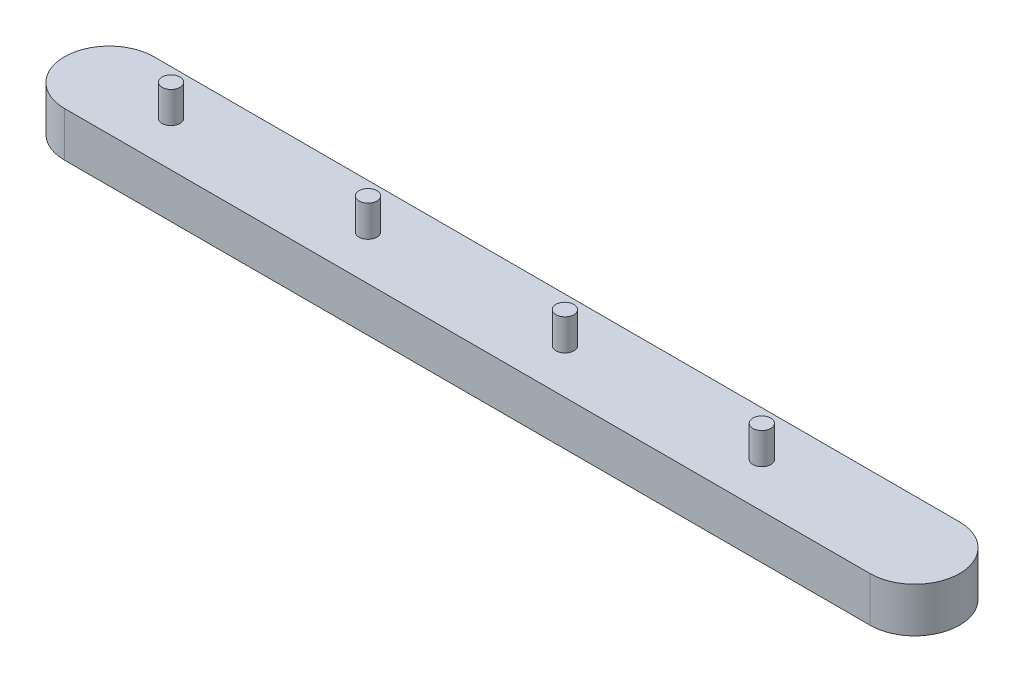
ISO-10303-21;
HEADER;
FILE_DESCRIPTION(('STEP AP214'),'2;1');
FILE_NAME('part.step','',(''),(''),'','','');
FILE_SCHEMA(('AUTOMOTIVE_DESIGN { 1 0 10303 214 1 1 1 1 }'));
ENDSEC;
DATA;
#1=APPLICATION_CONTEXT('core data for automotive mechanical design processes');
#2=APPLICATION_PROTOCOL_DEFINITION('international standard','automotive_design',2000,#1);
#3=PRODUCT_CONTEXT('',#1,'mechanical');
#4=PRODUCT('Part','Part','',(#3));
#5=PRODUCT_RELATED_PRODUCT_CATEGORY('part','',(#4));
#6=PRODUCT_DEFINITION_FORMATION('','',#4);
#7=PRODUCT_DEFINITION_CONTEXT('part definition',#1,'design');
#8=PRODUCT_DEFINITION('design','',#6,#7);
#9=PRODUCT_DEFINITION_SHAPE('','',#8);
#10=(LENGTH_UNIT() NAMED_UNIT(*) SI_UNIT(.MILLI.,.METRE.));
#11=(NAMED_UNIT(*) PLANE_ANGLE_UNIT() SI_UNIT($,.RADIAN.));
#12=(NAMED_UNIT(*) SI_UNIT($,.STERADIAN.) SOLID_ANGLE_UNIT());
#13=UNCERTAINTY_MEASURE_WITH_UNIT(LENGTH_MEASURE(1.E-05),#10,'distance_accuracy_value','');
#14=(GEOMETRIC_REPRESENTATION_CONTEXT(3) GLOBAL_UNCERTAINTY_ASSIGNED_CONTEXT((#13)) GLOBAL_UNIT_ASSIGNED_CONTEXT((#10,
#11,#12)) REPRESENTATION_CONTEXT('',''));
#15=CARTESIAN_POINT('',(0.,0.,0.));
#16=DIRECTION('',(0.,0.,1.));
#17=DIRECTION('',(1.,0.,0.));
#18=AXIS2_PLACEMENT_3D('',#15,#16,#17);
#19=CARTESIAN_POINT('',(-1056.,100.,0.));
#20=DIRECTION('',(0.,-1.,0.));
#21=DIRECTION('',(0.,0.,-1.));
#22=AXIS2_PLACEMENT_3D('',#19,#20,#21);
#23=CYLINDRICAL_SURFACE('',#22,100.);
#24=CARTESIAN_POINT('',(-1056.,0.,0.));
#25=DIRECTION('',(0.,1.,0.));
#26=DIRECTION('',(0.,0.,1.));
#27=AXIS2_PLACEMENT_3D('',#24,#25,#26);
#28=CIRCLE('',#27,100.);
#29=CARTESIAN_POINT('',(-1056.,0.,-100.));
#30=VERTEX_POINT('',#29);
#31=CARTESIAN_POINT('',(-1056.,0.,100.));
#32=VERTEX_POINT('',#31);
#33=EDGE_CURVE('E96',#30,#32,#28,.T.);
#34=ORIENTED_EDGE('',*,*,#33,.T.);
#35=DIRECTION('',(0.,-1.,0.));
#36=VECTOR('',#35,1.);
#37=CARTESIAN_POINT('',(-1056.,100.,100.));
#38=LINE('',#37,#36);
#39=CARTESIAN_POINT('',(-1056.,100.,100.));
#40=VERTEX_POINT('',#39);
#41=EDGE_CURVE('E11',#40,#32,#38,.T.);
#42=ORIENTED_EDGE('',*,*,#41,.F.);
#43=CARTESIAN_POINT('',(-1056.,100.,0.));
#44=DIRECTION('',(0.,1.,0.));
#45=DIRECTION('',(0.,0.,1.));
#46=AXIS2_PLACEMENT_3D('',#43,#44,#45);
#47=CIRCLE('',#46,100.);
#48=CARTESIAN_POINT('',(-1056.,100.,-100.));
#49=VERTEX_POINT('',#48);
#50=EDGE_CURVE('E84',#49,#40,#47,.T.);
#51=ORIENTED_EDGE('',*,*,#50,.F.);
#52=DIRECTION('',(0.,-1.,0.));
#53=VECTOR('',#52,1.);
#54=CARTESIAN_POINT('',(-1056.,100.,-100.));
#55=LINE('',#54,#53);
#56=EDGE_CURVE('E92',#49,#30,#55,.T.);
#57=ORIENTED_EDGE('',*,*,#56,.T.);
#58=EDGE_LOOP('',(#34,#42,#51,#57));
#59=FACE_BOUND('',#58,.T.);
#60=ADVANCED_FACE('F33',(#59),#23,.T.);
#61=CARTESIAN_POINT('',(-1056.,100.,100.));
#62=DIRECTION('',(0.,0.,-1.));
#63=DIRECTION('',(-1.,0.,0.));
#64=AXIS2_PLACEMENT_3D('',#61,#62,#63);
#65=PLANE('',#64);
#66=DIRECTION('',(1.,0.,0.));
#67=VECTOR('',#66,1.);
#68=CARTESIAN_POINT('',(-1056.,0.,100.));
#69=LINE('',#68,#67);
#70=CARTESIAN_POINT('',(744.,0.,100.));
#71=VERTEX_POINT('',#70);
#72=EDGE_CURVE('E88',#32,#71,#69,.T.);
#73=ORIENTED_EDGE('',*,*,#72,.T.);
#74=DIRECTION('',(0.,-1.,0.));
#75=VECTOR('',#74,1.);
#76=CARTESIAN_POINT('',(744.,100.,100.));
#77=LINE('',#76,#75);
#78=CARTESIAN_POINT('',(744.,100.,100.));
#79=VERTEX_POINT('',#78);
#80=EDGE_CURVE('E41',#79,#71,#77,.T.);
#81=ORIENTED_EDGE('',*,*,#80,.F.);
#82=DIRECTION('',(1.,0.,0.));
#83=VECTOR('',#82,1.);
#84=CARTESIAN_POINT('',(-1056.,100.,100.));
#85=LINE('',#84,#83);
#86=EDGE_CURVE('E79',#40,#79,#85,.T.);
#87=ORIENTED_EDGE('',*,*,#86,.F.);
#88=ORIENTED_EDGE('',*,*,#41,.T.);
#89=EDGE_LOOP('',(#73,#81,#87,#88));
#90=FACE_BOUND('',#89,.T.);
#91=ADVANCED_FACE('F87',(#90),#65,.F.);
#92=CARTESIAN_POINT('',(744.,100.,0.));
#93=DIRECTION('',(0.,-1.,0.));
#94=DIRECTION('',(0.,0.,-1.));
#95=AXIS2_PLACEMENT_3D('',#92,#93,#94);
#96=CYLINDRICAL_SURFACE('',#95,100.);
#97=CARTESIAN_POINT('',(744.,0.,0.));
#98=DIRECTION('',(0.,1.,0.));
#99=DIRECTION('',(0.,0.,1.));
#100=AXIS2_PLACEMENT_3D('',#97,#98,#99);
#101=CIRCLE('',#100,100.);
#102=CARTESIAN_POINT('',(744.,0.,-100.));
#103=VERTEX_POINT('',#102);
#104=EDGE_CURVE('E66',#71,#103,#101,.T.);
#105=ORIENTED_EDGE('',*,*,#104,.T.);
#106=DIRECTION('',(0.,-1.,0.));
#107=VECTOR('',#106,1.);
#108=CARTESIAN_POINT('',(744.,100.,-100.));
#109=LINE('',#108,#107);
#110=CARTESIAN_POINT('',(744.,100.,-100.));
#111=VERTEX_POINT('',#110);
#112=EDGE_CURVE('E89',#111,#103,#109,.T.);
#113=ORIENTED_EDGE('',*,*,#112,.F.);
#114=CARTESIAN_POINT('',(744.,100.,0.));
#115=DIRECTION('',(0.,1.,0.));
#116=DIRECTION('',(0.,0.,1.));
#117=AXIS2_PLACEMENT_3D('',#114,#115,#116);
#118=CIRCLE('',#117,100.);
#119=EDGE_CURVE('E82',#79,#111,#118,.T.);
#120=ORIENTED_EDGE('',*,*,#119,.F.);
#121=ORIENTED_EDGE('',*,*,#80,.T.);
#122=EDGE_LOOP('',(#105,#113,#120,#121));
#123=FACE_BOUND('',#122,.T.);
#124=ADVANCED_FACE('F90',(#123),#96,.T.);
#125=CARTESIAN_POINT('',(-1056.,100.,-100.));
#126=DIRECTION('',(0.,0.,1.));
#127=DIRECTION('',(1.,0.,0.));
#128=AXIS2_PLACEMENT_3D('',#125,#126,#127);
#129=PLANE('',#128);
#130=DIRECTION('',(-1.,0.,0.));
#131=VECTOR('',#130,1.);
#132=CARTESIAN_POINT('',(-1056.,0.,-100.));
#133=LINE('',#132,#131);
#134=EDGE_CURVE('E72',#103,#30,#133,.T.);
#135=ORIENTED_EDGE('',*,*,#134,.T.);
#136=ORIENTED_EDGE('',*,*,#56,.F.);
#137=DIRECTION('',(-1.,0.,0.));
#138=VECTOR('',#137,1.);
#139=CARTESIAN_POINT('',(-1056.,100.,-100.));
#140=LINE('',#139,#138);
#141=EDGE_CURVE('E49',#111,#49,#140,.T.);
#142=ORIENTED_EDGE('',*,*,#141,.F.);
#143=ORIENTED_EDGE('',*,*,#112,.T.);
#144=EDGE_LOOP('',(#135,#136,#142,#143));
#145=FACE_BOUND('',#144,.T.);
#146=ADVANCED_FACE('F104',(#145),#129,.F.);
#147=CARTESIAN_POINT('',(-1056.,100.,0.));
#148=DIRECTION('',(0.,1.,0.));
#149=DIRECTION('',(0.,0.,1.));
#150=AXIS2_PLACEMENT_3D('',#147,#148,#149);
#151=PLANE('',#150);
#152=CARTESIAN_POINT('',(402.245730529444,100.,0.));
#153=DIRECTION('',(0.,1.,0.));
#154=DIRECTION('',(0.,0.,1.));
#155=AXIS2_PLACEMENT_3D('',#152,#153,#154);
#156=CIRCLE('',#155,20.);
#157=CARTESIAN_POINT('',(402.245730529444,100.,20.));
#158=VERTEX_POINT('',#157);
#159=EDGE_CURVE('E128',#158,#158,#156,.T.);
#160=ORIENTED_EDGE('',*,*,#159,.F.);
#161=EDGE_LOOP('',(#160));
#162=FACE_BOUND('',#161,.T.);
#163=CARTESIAN_POINT('',(-37.7542694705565,100.,0.));
#164=DIRECTION('',(0.,1.,0.));
#165=DIRECTION('',(0.,0.,1.));
#166=AXIS2_PLACEMENT_3D('',#163,#164,#165);
#167=CIRCLE('',#166,20.);
#168=CARTESIAN_POINT('',(-37.7542694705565,100.,20.));
#169=VERTEX_POINT('',#168);
#170=EDGE_CURVE('E122',#169,#169,#167,.T.);
#171=ORIENTED_EDGE('',*,*,#170,.F.);
#172=EDGE_LOOP('',(#171));
#173=FACE_BOUND('',#172,.T.);
#174=CARTESIAN_POINT('',(-477.754269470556,100.,0.));
#175=DIRECTION('',(0.,1.,0.));
#176=DIRECTION('',(0.,0.,1.));
#177=AXIS2_PLACEMENT_3D('',#174,#175,#176);
#178=CIRCLE('',#177,20.);
#179=CARTESIAN_POINT('',(-477.754269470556,100.,20.));
#180=VERTEX_POINT('',#179);
#181=EDGE_CURVE('E116',#180,#180,#178,.T.);
#182=ORIENTED_EDGE('',*,*,#181,.F.);
#183=EDGE_LOOP('',(#182));
#184=FACE_BOUND('',#183,.T.);
#185=CARTESIAN_POINT('',(-917.754269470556,100.,0.));
#186=DIRECTION('',(0.,1.,0.));
#187=DIRECTION('',(0.,0.,1.));
#188=AXIS2_PLACEMENT_3D('',#185,#186,#187);
#189=CIRCLE('',#188,20.);
#190=CARTESIAN_POINT('',(-917.754269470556,100.,20.));
#191=VERTEX_POINT('',#190);
#192=EDGE_CURVE('E110',#191,#191,#189,.T.);
#193=ORIENTED_EDGE('',*,*,#192,.F.);
#194=EDGE_LOOP('',(#193));
#195=FACE_BOUND('',#194,.T.);
#196=ORIENTED_EDGE('',*,*,#50,.T.);
#197=ORIENTED_EDGE('',*,*,#86,.T.);
#198=ORIENTED_EDGE('',*,*,#119,.T.);
#199=ORIENTED_EDGE('',*,*,#141,.T.);
#200=EDGE_LOOP('',(#196,#197,#198,#199));
#201=FACE_BOUND('',#200,.T.);
#202=ADVANCED_FACE('F80',(#162,#173,#184,#195,#201),#151,.T.);
#203=CARTESIAN_POINT('',(-1056.,0.,0.));
#204=DIRECTION('',(0.,1.,0.));
#205=DIRECTION('',(0.,0.,1.));
#206=AXIS2_PLACEMENT_3D('',#203,#204,#205);
#207=PLANE('',#206);
#208=ORIENTED_EDGE('',*,*,#33,.F.);
#209=ORIENTED_EDGE('',*,*,#134,.F.);
#210=ORIENTED_EDGE('',*,*,#104,.F.);
#211=ORIENTED_EDGE('',*,*,#72,.F.);
#212=EDGE_LOOP('',(#208,#209,#210,#211));
#213=FACE_BOUND('',#212,.T.);
#214=ADVANCED_FACE('F107',(#213),#207,.F.);
#215=CARTESIAN_POINT('',(-917.754269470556,170.,0.));
#216=DIRECTION('',(0.,-1.,0.));
#217=DIRECTION('',(0.,0.,-1.));
#218=AXIS2_PLACEMENT_3D('',#215,#216,#217);
#219=CYLINDRICAL_SURFACE('',#218,20.);
#220=CARTESIAN_POINT('',(-917.754269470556,170.,0.));
#221=DIRECTION('',(0.,1.,0.));
#222=DIRECTION('',(0.,0.,1.));
#223=AXIS2_PLACEMENT_3D('',#220,#221,#222);
#224=CIRCLE('',#223,20.);
#225=CARTESIAN_POINT('',(-917.754269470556,170.,20.));
#226=VERTEX_POINT('',#225);
#227=EDGE_CURVE('E99',#226,#226,#224,.T.);
#228=ORIENTED_EDGE('',*,*,#227,.F.);
#229=EDGE_LOOP('',(#228));
#230=FACE_BOUND('',#229,.T.);
#231=ORIENTED_EDGE('',*,*,#192,.T.);
#232=EDGE_LOOP('',(#231));
#233=FACE_BOUND('',#232,.T.);
#234=ADVANCED_FACE('F152',(#230,#233),#219,.T.);
#235=CARTESIAN_POINT('',(-917.754269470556,170.,0.));
#236=DIRECTION('',(0.,1.,0.));
#237=DIRECTION('',(0.,0.,1.));
#238=AXIS2_PLACEMENT_3D('',#235,#236,#237);
#239=PLANE('',#238);
#240=ORIENTED_EDGE('',*,*,#227,.T.);
#241=EDGE_LOOP('',(#240));
#242=FACE_BOUND('',#241,.T.);
#243=ADVANCED_FACE('F154',(#242),#239,.T.);
#244=CARTESIAN_POINT('',(-477.754269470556,170.,0.));
#245=DIRECTION('',(0.,-1.,0.));
#246=DIRECTION('',(0.,0.,-1.));
#247=AXIS2_PLACEMENT_3D('',#244,#245,#246);
#248=CYLINDRICAL_SURFACE('',#247,20.);
#249=CARTESIAN_POINT('',(-477.754269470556,170.,0.));
#250=DIRECTION('',(0.,1.,0.));
#251=DIRECTION('',(0.,0.,1.));
#252=AXIS2_PLACEMENT_3D('',#249,#250,#251);
#253=CIRCLE('',#252,20.);
#254=CARTESIAN_POINT('',(-477.754269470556,170.,20.));
#255=VERTEX_POINT('',#254);
#256=EDGE_CURVE('E113',#255,#255,#253,.T.);
#257=ORIENTED_EDGE('',*,*,#256,.F.);
#258=EDGE_LOOP('',(#257));
#259=FACE_BOUND('',#258,.T.);
#260=ORIENTED_EDGE('',*,*,#181,.T.);
#261=EDGE_LOOP('',(#260));
#262=FACE_BOUND('',#261,.T.);
#263=ADVANCED_FACE('F161',(#259,#262),#248,.T.);
#264=CARTESIAN_POINT('',(-477.754269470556,170.,0.));
#265=DIRECTION('',(0.,1.,0.));
#266=DIRECTION('',(0.,0.,1.));
#267=AXIS2_PLACEMENT_3D('',#264,#265,#266);
#268=PLANE('',#267);
#269=ORIENTED_EDGE('',*,*,#256,.T.);
#270=EDGE_LOOP('',(#269));
#271=FACE_BOUND('',#270,.T.);
#272=ADVANCED_FACE('F209',(#271),#268,.T.);
#273=CARTESIAN_POINT('',(-37.7542694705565,170.,0.));
#274=DIRECTION('',(0.,-1.,0.));
#275=DIRECTION('',(0.,0.,-1.));
#276=AXIS2_PLACEMENT_3D('',#273,#274,#275);
#277=CYLINDRICAL_SURFACE('',#276,20.);
#278=CARTESIAN_POINT('',(-37.7542694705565,170.,0.));
#279=DIRECTION('',(0.,1.,0.));
#280=DIRECTION('',(0.,0.,1.));
#281=AXIS2_PLACEMENT_3D('',#278,#279,#280);
#282=CIRCLE('',#281,20.);
#283=CARTESIAN_POINT('',(-37.7542694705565,170.,20.));
#284=VERTEX_POINT('',#283);
#285=EDGE_CURVE('E119',#284,#284,#282,.T.);
#286=ORIENTED_EDGE('',*,*,#285,.F.);
#287=EDGE_LOOP('',(#286));
#288=FACE_BOUND('',#287,.T.);
#289=ORIENTED_EDGE('',*,*,#170,.T.);
#290=EDGE_LOOP('',(#289));
#291=FACE_BOUND('',#290,.T.);
#292=ADVANCED_FACE('F218',(#288,#291),#277,.T.);
#293=CARTESIAN_POINT('',(-37.7542694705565,170.,0.));
#294=DIRECTION('',(0.,1.,0.));
#295=DIRECTION('',(0.,0.,1.));
#296=AXIS2_PLACEMENT_3D('',#293,#294,#295);
#297=PLANE('',#296);
#298=ORIENTED_EDGE('',*,*,#285,.T.);
#299=EDGE_LOOP('',(#298));
#300=FACE_BOUND('',#299,.T.);
#301=ADVANCED_FACE('F139',(#300),#297,.T.);
#302=CARTESIAN_POINT('',(402.245730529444,170.,0.));
#303=DIRECTION('',(0.,-1.,0.));
#304=DIRECTION('',(0.,0.,-1.));
#305=AXIS2_PLACEMENT_3D('',#302,#303,#304);
#306=CYLINDRICAL_SURFACE('',#305,20.);
#307=CARTESIAN_POINT('',(402.245730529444,170.,0.));
#308=DIRECTION('',(0.,1.,0.));
#309=DIRECTION('',(0.,0.,1.));
#310=AXIS2_PLACEMENT_3D('',#307,#308,#309);
#311=CIRCLE('',#310,20.);
#312=CARTESIAN_POINT('',(402.245730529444,170.,20.));
#313=VERTEX_POINT('',#312);
#314=EDGE_CURVE('E125',#313,#313,#311,.T.);
#315=ORIENTED_EDGE('',*,*,#314,.F.);
#316=EDGE_LOOP('',(#315));
#317=FACE_BOUND('',#316,.T.);
#318=ORIENTED_EDGE('',*,*,#159,.T.);
#319=EDGE_LOOP('',(#318));
#320=FACE_BOUND('',#319,.T.);
#321=ADVANCED_FACE('F136',(#317,#320),#306,.T.);
#322=CARTESIAN_POINT('',(402.245730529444,170.,0.));
#323=DIRECTION('',(0.,1.,0.));
#324=DIRECTION('',(0.,0.,1.));
#325=AXIS2_PLACEMENT_3D('',#322,#323,#324);
#326=PLANE('',#325);
#327=ORIENTED_EDGE('',*,*,#314,.T.);
#328=EDGE_LOOP('',(#327));
#329=FACE_BOUND('',#328,.T.);
#330=ADVANCED_FACE('F134',(#329),#326,.T.);
#331=CLOSED_SHELL('',(#60,#91,#124,#146,#202,#214,#234,#243,#263,#272,#292,#301,#321,#330));
#332=MANIFOLD_SOLID_BREP('B2',#331);
#333=ADVANCED_BREP_SHAPE_REPRESENTATION('',(#18,#332),#14);
#334=SHAPE_DEFINITION_REPRESENTATION(#9,#333);
ENDSEC;
END-ISO-10303-21;
